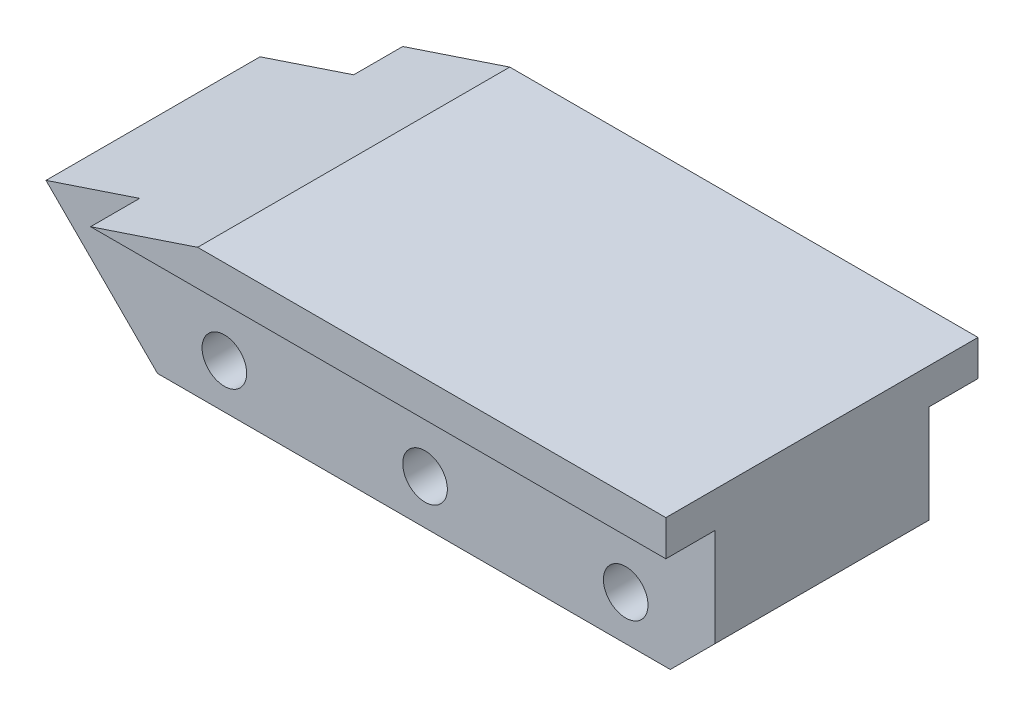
from build123d import *

# Parameters (mm, degrees)
SKETCH_5_R          = 5
EXTRUDE_1_DEPTH     = 70
SKETCH_6_W          = 11
SKETCH_6_H          = 32
CUT_EXTRUDE_3_DEPTH = 167.98816248
CHAMFER_3_SIZE      = 10


with BuildPart() as part:
    # Sketch 5 → Extrude 1 (new body)
    with BuildSketch(Plane.XY):
        Polygon((-49.879520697, 2.976230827), (-4.879520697, 17.976230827), (100.120479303, 17.976230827), (100.120479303, -22.023769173), (-24.879520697, -22.023769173), align=None)
        with Locations((80.120479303, -12.023769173)):
            Circle(SKETCH_5_R, mode=Mode.SUBTRACT)
        with Locations((35.120479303, -12.023769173)):
            Circle(SKETCH_5_R, mode=Mode.SUBTRACT)
        with Locations((-9.879520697, -12.023769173)):
            Circle(SKETCH_5_R, mode=Mode.SUBTRACT)
    extrude(amount=EXTRUDE_1_DEPTH)

    # Sketch 6 → Cut-Extrude 3 (cut, through all)
    with BuildSketch(Plane(origin=(100.120479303, 0, 0), x_dir=(0, 0, -1), z_dir=(1, 0, 0))):
        with Locations((-64.5, -6.023769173)):
            Rectangle(SKETCH_6_W, SKETCH_6_H)
        with Locations((-5.5, -6.023769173)):
            Rectangle(SKETCH_6_W, SKETCH_6_H)
    extrude(amount=-CUT_EXTRUDE_3_DEPTH, mode=Mode.SUBTRACT)

    # Chamfer 3
    chamfer_3_edges = [part.edges().sort_by_distance(p)[0] for p in [
        (100.120479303, -22.023769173, 35),
    ]]
    chamfer(chamfer_3_edges, length=CHAMFER_3_SIZE)


solid = part.part
